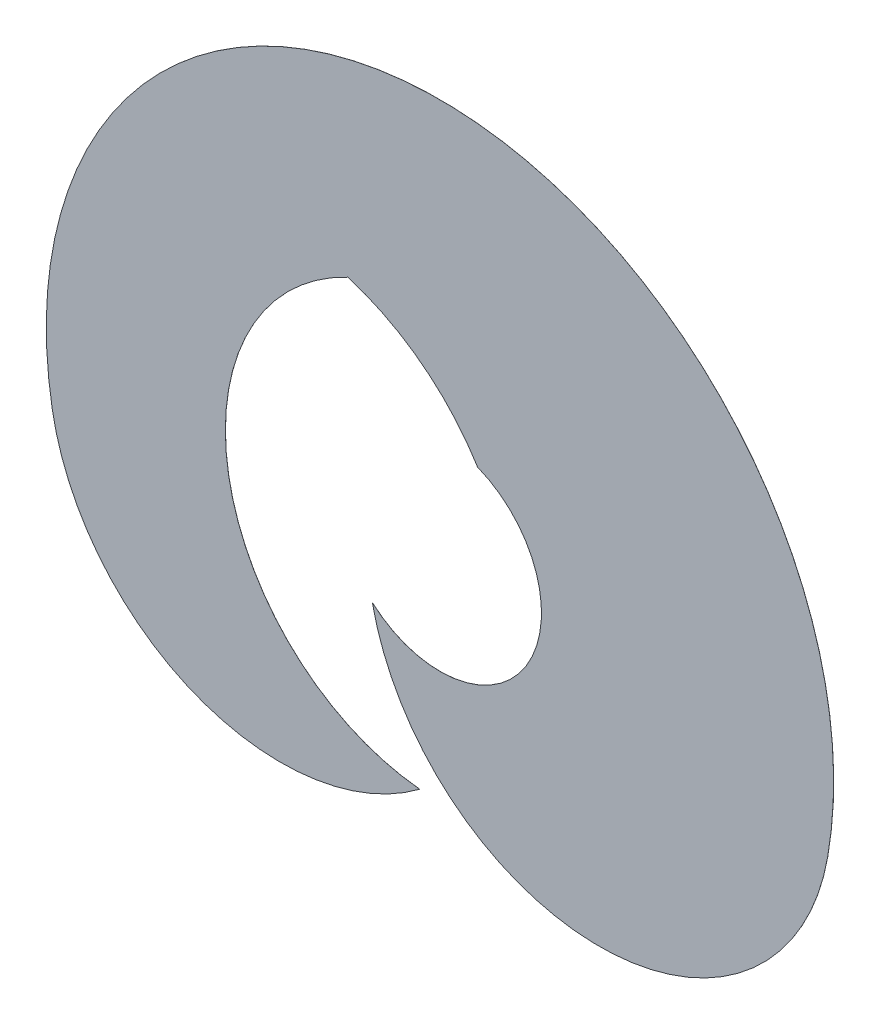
from build123d import *

# Parameters (mm, degrees)
EXTRUDE_1_DEPTH = 0.5


with BuildPart() as part:
    # Sketch 1 → Extrude 1 (new body)
    with BuildSketch(Plane.XY):
        with BuildLine():
            ThreePointArc((3053.717135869, 112.629022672), (250, 3453.968991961), (-2553.717135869, 112.629022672))
            ThreePointArc((-2553.717135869, 112.629022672), (-1518.884155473, -1155.641539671), (103.480009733, -938.100665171))
            ThreePointArc((103.480009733, -938.100665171), (-1278.453414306, 337.492424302), (-416.139304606, 2008.806905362))
            ThreePointArc((-416.139304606, 2008.806905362), (118.648968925, 1734.260583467), (522.253742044, 1288.752595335))
            ThreePointArc((522.253742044, 1288.752595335), (874.118875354, 220.497308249), (-239.007952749, 59.478380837))
            ThreePointArc((-239.007952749, 59.478380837), (-61.284437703, -414.926523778), (250, -814.610974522))
            ThreePointArc((250, -814.610974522), (1928.780277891, -1188.32558816), (3053.717135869, 112.629022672))
        make_face()
    extrude(amount=EXTRUDE_1_DEPTH)


solid = part.part
